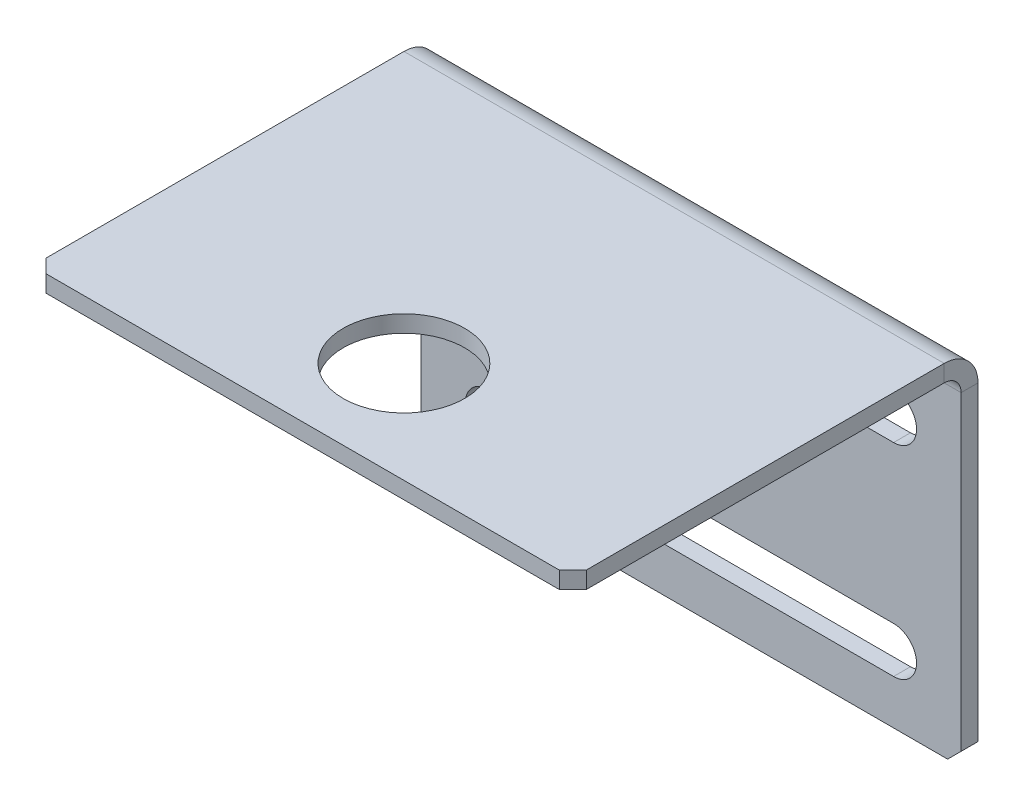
ISO-10303-21;
HEADER;
FILE_DESCRIPTION(('STEP AP214'),'2;1');
FILE_NAME('part.step','',(''),(''),'','','');
FILE_SCHEMA(('AUTOMOTIVE_DESIGN { 1 0 10303 214 1 1 1 1 }'));
ENDSEC;
DATA;
#1=APPLICATION_CONTEXT('core data for automotive mechanical design processes');
#2=APPLICATION_PROTOCOL_DEFINITION('international standard','automotive_design',2000,#1);
#3=PRODUCT_CONTEXT('',#1,'mechanical');
#4=PRODUCT('Part','Part','',(#3));
#5=PRODUCT_RELATED_PRODUCT_CATEGORY('part','',(#4));
#6=PRODUCT_DEFINITION_FORMATION('','',#4);
#7=PRODUCT_DEFINITION_CONTEXT('part definition',#1,'design');
#8=PRODUCT_DEFINITION('design','',#6,#7);
#9=PRODUCT_DEFINITION_SHAPE('','',#8);
#10=(LENGTH_UNIT() NAMED_UNIT(*) SI_UNIT(.MILLI.,.METRE.));
#11=(NAMED_UNIT(*) PLANE_ANGLE_UNIT() SI_UNIT($,.RADIAN.));
#12=(NAMED_UNIT(*) SI_UNIT($,.STERADIAN.) SOLID_ANGLE_UNIT());
#13=UNCERTAINTY_MEASURE_WITH_UNIT(LENGTH_MEASURE(1.E-05),#10,'distance_accuracy_value','');
#14=(GEOMETRIC_REPRESENTATION_CONTEXT(3) GLOBAL_UNCERTAINTY_ASSIGNED_CONTEXT((#13)) GLOBAL_UNIT_ASSIGNED_CONTEXT((#10,
#11,#12)) REPRESENTATION_CONTEXT('',''));
#15=CARTESIAN_POINT('',(0.,0.,0.));
#16=DIRECTION('',(0.,0.,1.));
#17=DIRECTION('',(1.,0.,0.));
#18=AXIS2_PLACEMENT_3D('',#15,#16,#17);
#19=CARTESIAN_POINT('',(40.,48.,9.43689570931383E-13));
#20=DIRECTION('',(1.,0.,0.));
#21=DIRECTION('',(0.,0.,-1.));
#22=AXIS2_PLACEMENT_3D('',#19,#20,#21);
#23=PLANE('',#22);
#24=DIRECTION('',(0.,0.,1.));
#25=VECTOR('',#24,1.);
#26=CARTESIAN_POINT('',(40.,48.,9.43689570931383E-13));
#27=LINE('',#26,#25);
#28=CARTESIAN_POINT('',(40.,48.,9.43689570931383E-13));
#29=VERTEX_POINT('',#28);
#30=CARTESIAN_POINT('',(40.,48.,2.50000000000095));
#31=VERTEX_POINT('',#30);
#32=EDGE_CURVE('E358',#29,#31,#27,.T.);
#33=ORIENTED_EDGE('',*,*,#32,.F.);
#34=CARTESIAN_POINT('',(40.,48.,5.00000000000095));
#35=DIRECTION('',(-1.,0.,0.));
#36=DIRECTION('',(0.,0.,1.));
#37=AXIS2_PLACEMENT_3D('',#34,#35,#36);
#38=CIRCLE('',#37,5.);
#39=CARTESIAN_POINT('',(40.,53.,5.00000000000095));
#40=VERTEX_POINT('',#39);
#41=EDGE_CURVE('E314',#29,#40,#38,.F.);
#42=ORIENTED_EDGE('',*,*,#41,.T.);
#43=DIRECTION('',(0.,1.,0.));
#44=VECTOR('',#43,1.);
#45=CARTESIAN_POINT('',(40.,50.5,5.00000000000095));
#46=LINE('',#45,#44);
#47=CARTESIAN_POINT('',(40.,50.5,5.00000000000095));
#48=VERTEX_POINT('',#47);
#49=EDGE_CURVE('E355',#48,#40,#46,.T.);
#50=ORIENTED_EDGE('',*,*,#49,.F.);
#51=CARTESIAN_POINT('',(40.,48.,5.00000000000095));
#52=DIRECTION('',(1.,0.,0.));
#53=DIRECTION('',(0.,0.,-1.));
#54=AXIS2_PLACEMENT_3D('',#51,#52,#53);
#55=CIRCLE('',#54,2.5);
#56=EDGE_CURVE('E304',#31,#48,#55,.T.);
#57=ORIENTED_EDGE('',*,*,#56,.F.);
#58=EDGE_LOOP('',(#33,#42,#50,#57));
#59=FACE_BOUND('',#58,.T.);
#60=ADVANCED_FACE('F40',(#59),#23,.T.);
#61=CARTESIAN_POINT('',(40.,50.5,5.00000000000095));
#62=DIRECTION('',(1.,0.,0.));
#63=DIRECTION('',(0.,0.,-1.));
#64=AXIS2_PLACEMENT_3D('',#61,#62,#63);
#65=PLANE('',#64);
#66=DIRECTION('',(0.,1.,0.));
#67=VECTOR('',#66,1.);
#68=CARTESIAN_POINT('',(40.,0.,2.50000000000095));
#69=LINE('',#68,#67);
#70=CARTESIAN_POINT('',(40.,2.,2.50000000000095));
#71=VERTEX_POINT('',#70);
#72=EDGE_CURVE('E308',#71,#31,#69,.T.);
#73=ORIENTED_EDGE('',*,*,#72,.F.);
#74=DIRECTION('',(0.,0.,-1.));
#75=VECTOR('',#74,1.);
#76=CARTESIAN_POINT('',(40.,2.,5.00000000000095));
#77=LINE('',#76,#75);
#78=CARTESIAN_POINT('',(40.,2.,9.43689570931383E-13));
#79=VERTEX_POINT('',#78);
#80=EDGE_CURVE('E384',#71,#79,#77,.T.);
#81=ORIENTED_EDGE('',*,*,#80,.T.);
#82=DIRECTION('',(0.,1.,0.));
#83=VECTOR('',#82,1.);
#84=CARTESIAN_POINT('',(40.,0.,9.43689570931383E-13));
#85=LINE('',#84,#83);
#86=EDGE_CURVE('E311',#79,#29,#85,.T.);
#87=ORIENTED_EDGE('',*,*,#86,.T.);
#88=ORIENTED_EDGE('',*,*,#32,.T.);
#89=EDGE_LOOP('',(#73,#81,#87,#88));
#90=FACE_BOUND('',#89,.T.);
#91=ADVANCED_FACE('F464',(#90),#65,.T.);
#92=CARTESIAN_POINT('',(-39.9999999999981,53.,5.00000000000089));
#93=DIRECTION('',(-1.,0.,0.));
#94=DIRECTION('',(0.,0.,1.));
#95=AXIS2_PLACEMENT_3D('',#92,#93,#94);
#96=PLANE('',#95);
#97=DIRECTION('',(0.,-1.,0.));
#98=VECTOR('',#97,1.);
#99=CARTESIAN_POINT('',(-39.9999999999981,53.,5.00000000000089));
#100=LINE('',#99,#98);
#101=CARTESIAN_POINT('',(-39.9999999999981,53.,5.00000000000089));
#102=VERTEX_POINT('',#101);
#103=CARTESIAN_POINT('',(-39.9999999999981,50.5,5.00000000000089));
#104=VERTEX_POINT('',#103);
#105=EDGE_CURVE('E352',#102,#104,#100,.T.);
#106=ORIENTED_EDGE('',*,*,#105,.F.);
#107=CARTESIAN_POINT('',(-39.9999999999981,48.,5.00000000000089));
#108=DIRECTION('',(-1.,0.,0.));
#109=DIRECTION('',(0.,0.,1.));
#110=AXIS2_PLACEMENT_3D('',#107,#108,#109);
#111=CIRCLE('',#110,5.);
#112=CARTESIAN_POINT('',(-39.9999999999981,48.,9.43689570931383E-13));
#113=VERTEX_POINT('',#112);
#114=EDGE_CURVE('E292',#113,#102,#111,.F.);
#115=ORIENTED_EDGE('',*,*,#114,.F.);
#116=DIRECTION('',(0.,0.,-1.));
#117=VECTOR('',#116,1.);
#118=CARTESIAN_POINT('',(-39.9999999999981,48.,2.50000000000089));
#119=LINE('',#118,#117);
#120=CARTESIAN_POINT('',(-39.9999999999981,48.,2.50000000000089));
#121=VERTEX_POINT('',#120);
#122=EDGE_CURVE('E348',#121,#113,#119,.T.);
#123=ORIENTED_EDGE('',*,*,#122,.F.);
#124=CARTESIAN_POINT('',(-39.9999999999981,48.,5.00000000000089));
#125=DIRECTION('',(1.,0.,0.));
#126=DIRECTION('',(0.,0.,-1.));
#127=AXIS2_PLACEMENT_3D('',#124,#125,#126);
#128=CIRCLE('',#127,2.5);
#129=EDGE_CURVE('E282',#121,#104,#128,.T.);
#130=ORIENTED_EDGE('',*,*,#129,.T.);
#131=EDGE_LOOP('',(#106,#115,#123,#130));
#132=FACE_BOUND('',#131,.T.);
#133=ADVANCED_FACE('F438',(#132),#96,.T.);
#134=CARTESIAN_POINT('',(-39.9999999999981,48.,2.50000000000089));
#135=DIRECTION('',(-1.,0.,0.));
#136=DIRECTION('',(0.,0.,1.));
#137=AXIS2_PLACEMENT_3D('',#134,#135,#136);
#138=PLANE('',#137);
#139=DIRECTION('',(0.,0.,1.));
#140=VECTOR('',#139,1.);
#141=CARTESIAN_POINT('',(-39.9999999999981,50.5,9.43689570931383E-13));
#142=LINE('',#141,#140);
#143=CARTESIAN_POINT('',(-40.,50.5,58.));
#144=VERTEX_POINT('',#143);
#145=EDGE_CURVE('E278',#104,#144,#142,.T.);
#146=ORIENTED_EDGE('',*,*,#145,.T.);
#147=DIRECTION('',(0.,1.,0.));
#148=VECTOR('',#147,1.);
#149=CARTESIAN_POINT('',(-40.,47.9999999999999,58.));
#150=LINE('',#149,#148);
#151=CARTESIAN_POINT('',(-40.,52.9999999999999,58.));
#152=VERTEX_POINT('',#151);
#153=EDGE_CURVE('E403',#144,#152,#150,.T.);
#154=ORIENTED_EDGE('',*,*,#153,.T.);
#155=DIRECTION('',(0.,0.,1.));
#156=VECTOR('',#155,1.);
#157=CARTESIAN_POINT('',(-39.9999999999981,53.,9.43689570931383E-13));
#158=LINE('',#157,#156);
#159=EDGE_CURVE('E271',#102,#152,#158,.T.);
#160=ORIENTED_EDGE('',*,*,#159,.F.);
#161=ORIENTED_EDGE('',*,*,#105,.T.);
#162=EDGE_LOOP('',(#146,#154,#160,#161));
#163=FACE_BOUND('',#162,.T.);
#164=ADVANCED_FACE('F426',(#163),#138,.T.);
#165=CARTESIAN_POINT('',(40.,53.,9.43689570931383E-13));
#166=DIRECTION('',(0.,-1.,0.));
#167=DIRECTION('',(0.,0.,-1.));
#168=AXIS2_PLACEMENT_3D('',#165,#166,#167);
#169=PLANE('',#168);
#170=CARTESIAN_POINT('',(0.,52.9999999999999,45.));
#171=DIRECTION('',(0.,1.,0.));
#172=DIRECTION('',(0.,0.,1.));
#173=AXIS2_PLACEMENT_3D('',#170,#171,#172);
#174=CIRCLE('',#173,9.);
#175=CARTESIAN_POINT('',(1.88737914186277E-12,52.9999999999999,54.));
#176=VERTEX_POINT('',#175);
#177=EDGE_CURVE('E267',#176,#176,#174,.T.);
#178=ORIENTED_EDGE('',*,*,#177,.F.);
#179=EDGE_LOOP('',(#178));
#180=FACE_BOUND('',#179,.T.);
#181=ORIENTED_EDGE('',*,*,#159,.T.);
#182=DIRECTION('',(-0.707106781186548,0.,-0.707106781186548));
#183=VECTOR('',#182,1.);
#184=CARTESIAN_POINT('',(-40.,52.9999999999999,58.));
#185=LINE('',#184,#183);
#186=CARTESIAN_POINT('',(-38.,52.9999999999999,60.0000000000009));
#187=VERTEX_POINT('',#186);
#188=EDGE_CURVE('E407',#152,#187,#185,.F.);
#189=ORIENTED_EDGE('',*,*,#188,.T.);
#190=DIRECTION('',(-1.,0.,0.));
#191=VECTOR('',#190,1.);
#192=CARTESIAN_POINT('',(40.,53.,60.0000000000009));
#193=LINE('',#192,#191);
#194=CARTESIAN_POINT('',(38.,53.,60.0000000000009));
#195=VERTEX_POINT('',#194);
#196=EDGE_CURVE('E344',#195,#187,#193,.T.);
#197=ORIENTED_EDGE('',*,*,#196,.F.);
#198=DIRECTION('',(-0.707106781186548,0.,0.707106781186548));
#199=VECTOR('',#198,1.);
#200=CARTESIAN_POINT('',(38.,53.,60.0000000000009));
#201=LINE('',#200,#199);
#202=CARTESIAN_POINT('',(40.,53.,58.0000000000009));
#203=VERTEX_POINT('',#202);
#204=EDGE_CURVE('E394',#195,#203,#201,.F.);
#205=ORIENTED_EDGE('',*,*,#204,.T.);
#206=DIRECTION('',(0.,0.,1.));
#207=VECTOR('',#206,1.);
#208=CARTESIAN_POINT('',(40.,53.,9.43689570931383E-13));
#209=LINE('',#208,#207);
#210=EDGE_CURVE('E296',#40,#203,#209,.T.);
#211=ORIENTED_EDGE('',*,*,#210,.F.);
#212=DIRECTION('',(-1.,0.,0.));
#213=VECTOR('',#212,1.);
#214=CARTESIAN_POINT('',(40.,53.,5.00000000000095));
#215=LINE('',#214,#213);
#216=EDGE_CURVE('E318',#40,#102,#215,.T.);
#217=ORIENTED_EDGE('',*,*,#216,.T.);
#218=EDGE_LOOP('',(#181,#189,#197,#205,#211,#217));
#219=FACE_BOUND('',#218,.T.);
#220=ADVANCED_FACE('F428',(#180,#219),#169,.F.);
#221=CARTESIAN_POINT('',(40.,50.5,60.0000000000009));
#222=DIRECTION('',(0.,0.,1.));
#223=DIRECTION('',(1.,0.,0.));
#224=AXIS2_PLACEMENT_3D('',#221,#222,#223);
#225=PLANE('',#224);
#226=ORIENTED_EDGE('',*,*,#196,.T.);
#227=DIRECTION('',(0.,-1.,0.));
#228=VECTOR('',#227,1.);
#229=CARTESIAN_POINT('',(-38.,50.5,60.0000000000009));
#230=LINE('',#229,#228);
#231=CARTESIAN_POINT('',(-37.9999999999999,50.5,60.0000000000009));
#232=VERTEX_POINT('',#231);
#233=EDGE_CURVE('E48',#187,#232,#230,.T.);
#234=ORIENTED_EDGE('',*,*,#233,.T.);
#235=DIRECTION('',(-1.,0.,0.));
#236=VECTOR('',#235,1.);
#237=CARTESIAN_POINT('',(40.,50.5,60.0000000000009));
#238=LINE('',#237,#236);
#239=CARTESIAN_POINT('',(38.,50.5,60.0000000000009));
#240=VERTEX_POINT('',#239);
#241=EDGE_CURVE('E340',#240,#232,#238,.T.);
#242=ORIENTED_EDGE('',*,*,#241,.F.);
#243=DIRECTION('',(0.,1.,0.));
#244=VECTOR('',#243,1.);
#245=CARTESIAN_POINT('',(38.,50.5,60.0000000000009));
#246=LINE('',#245,#244);
#247=EDGE_CURVE('E390',#240,#195,#246,.T.);
#248=ORIENTED_EDGE('',*,*,#247,.T.);
#249=EDGE_LOOP('',(#226,#234,#242,#248));
#250=FACE_BOUND('',#249,.T.);
#251=ADVANCED_FACE('F413',(#250),#225,.T.);
#252=CARTESIAN_POINT('',(40.,50.5,9.43689570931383E-13));
#253=DIRECTION('',(0.,-1.,0.));
#254=DIRECTION('',(0.,0.,-1.));
#255=AXIS2_PLACEMENT_3D('',#252,#253,#254);
#256=PLANE('',#255);
#257=CARTESIAN_POINT('',(0.,50.5,45.));
#258=DIRECTION('',(0.,-1.,0.));
#259=DIRECTION('',(0.,0.,-1.));
#260=AXIS2_PLACEMENT_3D('',#257,#258,#259);
#261=CIRCLE('',#260,9.);
#262=CARTESIAN_POINT('',(1.88737914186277E-12,50.5,54.));
#263=VERTEX_POINT('',#262);
#264=EDGE_CURVE('E266',#263,#263,#261,.F.);
#265=ORIENTED_EDGE('',*,*,#264,.T.);
#266=EDGE_LOOP('',(#265));
#267=FACE_BOUND('',#266,.T.);
#268=ORIENTED_EDGE('',*,*,#241,.T.);
#269=DIRECTION('',(0.707106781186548,0.,0.707106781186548));
#270=VECTOR('',#269,1.);
#271=CARTESIAN_POINT('',(-28.9999999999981,50.5,69.));
#272=LINE('',#271,#270);
#273=EDGE_CURVE('E11',#232,#144,#272,.F.);
#274=ORIENTED_EDGE('',*,*,#273,.T.);
#275=ORIENTED_EDGE('',*,*,#145,.F.);
#276=DIRECTION('',(-1.,0.,0.));
#277=VECTOR('',#276,1.);
#278=CARTESIAN_POINT('',(40.,50.5,5.00000000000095));
#279=LINE('',#278,#277);
#280=EDGE_CURVE('E336',#48,#104,#279,.T.);
#281=ORIENTED_EDGE('',*,*,#280,.F.);
#282=DIRECTION('',(0.,0.,1.));
#283=VECTOR('',#282,1.);
#284=CARTESIAN_POINT('',(40.,50.5,9.43689570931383E-13));
#285=LINE('',#284,#283);
#286=CARTESIAN_POINT('',(40.,50.5,58.0000000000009));
#287=VERTEX_POINT('',#286);
#288=EDGE_CURVE('E300',#48,#287,#285,.T.);
#289=ORIENTED_EDGE('',*,*,#288,.T.);
#290=DIRECTION('',(0.707106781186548,0.,-0.707106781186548));
#291=VECTOR('',#290,1.);
#292=CARTESIAN_POINT('',(69.,50.4999999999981,29.0000000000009));
#293=LINE('',#292,#291);
#294=EDGE_CURVE('E400',#287,#240,#293,.F.);
#295=ORIENTED_EDGE('',*,*,#294,.T.);
#296=EDGE_LOOP('',(#268,#274,#275,#281,#289,#295));
#297=FACE_BOUND('',#296,.T.);
#298=ADVANCED_FACE('F419',(#267,#297),#256,.T.);
#299=CARTESIAN_POINT('',(40.,48.,5.00000000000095));
#300=DIRECTION('',(-1.,0.,0.));
#301=DIRECTION('',(0.,0.,1.));
#302=AXIS2_PLACEMENT_3D('',#299,#300,#301);
#303=CYLINDRICAL_SURFACE('',#302,2.5);
#304=ORIENTED_EDGE('',*,*,#129,.F.);
#305=DIRECTION('',(-1.,0.,0.));
#306=VECTOR('',#305,1.);
#307=CARTESIAN_POINT('',(40.,48.,2.50000000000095));
#308=LINE('',#307,#306);
#309=EDGE_CURVE('E332',#31,#121,#308,.T.);
#310=ORIENTED_EDGE('',*,*,#309,.F.);
#311=ORIENTED_EDGE('',*,*,#56,.T.);
#312=ORIENTED_EDGE('',*,*,#280,.T.);
#313=EDGE_LOOP('',(#304,#310,#311,#312));
#314=FACE_BOUND('',#313,.T.);
#315=ADVANCED_FACE('F442',(#314),#303,.F.);
#316=CARTESIAN_POINT('',(40.,0.,2.50000000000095));
#317=DIRECTION('',(0.,0.,1.));
#318=DIRECTION('',(1.,0.,0.));
#319=AXIS2_PLACEMENT_3D('',#316,#317,#318);
#320=PLANE('',#319);
#321=CARTESIAN_POINT('',(-29.9999999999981,40.,2.5));
#322=DIRECTION('',(0.,0.,1.));
#323=DIRECTION('',(-1.,0.,0.));
#324=AXIS2_PLACEMENT_3D('',#321,#322,#323);
#325=CIRCLE('',#324,3.4);
#326=CARTESIAN_POINT('',(-29.9999999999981,43.4,2.5));
#327=VERTEX_POINT('',#326);
#328=CARTESIAN_POINT('',(-29.9999999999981,36.6,2.5));
#329=VERTEX_POINT('',#328);
#330=EDGE_CURVE('E55',#327,#329,#325,.T.);
#331=ORIENTED_EDGE('',*,*,#330,.F.);
#332=DIRECTION('',(-1.,0.,0.));
#333=VECTOR('',#332,1.);
#334=CARTESIAN_POINT('',(-29.9999999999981,43.4,2.5));
#335=LINE('',#334,#333);
#336=CARTESIAN_POINT('',(30.,43.4,2.5));
#337=VERTEX_POINT('',#336);
#338=EDGE_CURVE('E185',#337,#327,#335,.T.);
#339=ORIENTED_EDGE('',*,*,#338,.F.);
#340=CARTESIAN_POINT('',(30.,40.,2.5));
#341=DIRECTION('',(0.,0.,1.));
#342=DIRECTION('',(1.,0.,0.));
#343=AXIS2_PLACEMENT_3D('',#340,#341,#342);
#344=CIRCLE('',#343,3.4);
#345=CARTESIAN_POINT('',(30.,36.6,2.5));
#346=VERTEX_POINT('',#345);
#347=EDGE_CURVE('E212',#346,#337,#344,.T.);
#348=ORIENTED_EDGE('',*,*,#347,.F.);
#349=DIRECTION('',(1.,0.,0.));
#350=VECTOR('',#349,1.);
#351=CARTESIAN_POINT('',(-29.9999999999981,36.6,2.5));
#352=LINE('',#351,#350);
#353=EDGE_CURVE('E204',#329,#346,#352,.T.);
#354=ORIENTED_EDGE('',*,*,#353,.F.);
#355=EDGE_LOOP('',(#331,#339,#348,#354));
#356=FACE_BOUND('',#355,.T.);
#357=CARTESIAN_POINT('',(-29.9999999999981,10.,2.5));
#358=DIRECTION('',(0.,0.,1.));
#359=DIRECTION('',(-1.,0.,0.));
#360=AXIS2_PLACEMENT_3D('',#357,#358,#359);
#361=CIRCLE('',#360,3.4);
#362=CARTESIAN_POINT('',(-29.9999999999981,13.4,2.5));
#363=VERTEX_POINT('',#362);
#364=CARTESIAN_POINT('',(-29.9999999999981,6.60000000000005,2.5));
#365=VERTEX_POINT('',#364);
#366=EDGE_CURVE('E236',#363,#365,#361,.T.);
#367=ORIENTED_EDGE('',*,*,#366,.F.);
#368=DIRECTION('',(-1.,0.,0.));
#369=VECTOR('',#368,1.);
#370=CARTESIAN_POINT('',(-29.9999999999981,13.4,2.5));
#371=LINE('',#370,#369);
#372=CARTESIAN_POINT('',(30.,13.4,2.5));
#373=VERTEX_POINT('',#372);
#374=EDGE_CURVE('E246',#373,#363,#371,.T.);
#375=ORIENTED_EDGE('',*,*,#374,.F.);
#376=CARTESIAN_POINT('',(30.,10.,2.5));
#377=DIRECTION('',(0.,0.,1.));
#378=DIRECTION('',(1.,0.,0.));
#379=AXIS2_PLACEMENT_3D('',#376,#377,#378);
#380=CIRCLE('',#379,3.4);
#381=CARTESIAN_POINT('',(30.,6.60000000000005,2.5));
#382=VERTEX_POINT('',#381);
#383=EDGE_CURVE('E242',#382,#373,#380,.T.);
#384=ORIENTED_EDGE('',*,*,#383,.F.);
#385=DIRECTION('',(1.,0.,0.));
#386=VECTOR('',#385,1.);
#387=CARTESIAN_POINT('',(-29.9999999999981,6.60000000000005,2.5));
#388=LINE('',#387,#386);
#389=EDGE_CURVE('E238',#365,#382,#388,.T.);
#390=ORIENTED_EDGE('',*,*,#389,.F.);
#391=EDGE_LOOP('',(#367,#375,#384,#390));
#392=FACE_BOUND('',#391,.T.);
#393=DIRECTION('',(-1.,0.,0.));
#394=VECTOR('',#393,1.);
#395=CARTESIAN_POINT('',(40.,0.,2.50000000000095));
#396=LINE('',#395,#394);
#397=CARTESIAN_POINT('',(38.,0.,2.5));
#398=VERTEX_POINT('',#397);
#399=CARTESIAN_POINT('',(-37.9999999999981,0.,2.50000000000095));
#400=VERTEX_POINT('',#399);
#401=EDGE_CURVE('E329',#398,#400,#396,.T.);
#402=ORIENTED_EDGE('',*,*,#401,.F.);
#403=DIRECTION('',(-0.707106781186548,-0.707106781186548,0.));
#404=VECTOR('',#403,1.);
#405=CARTESIAN_POINT('',(39.,1.,2.50000000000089));
#406=LINE('',#405,#404);
#407=EDGE_CURVE('E381',#398,#71,#406,.F.);
#408=ORIENTED_EDGE('',*,*,#407,.T.);
#409=ORIENTED_EDGE('',*,*,#72,.T.);
#410=ORIENTED_EDGE('',*,*,#309,.T.);
#411=DIRECTION('',(0.,1.,0.));
#412=VECTOR('',#411,1.);
#413=CARTESIAN_POINT('',(-39.9999999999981,0.,2.5));
#414=LINE('',#413,#412);
#415=CARTESIAN_POINT('',(-39.9999999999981,2.,2.5));
#416=VERTEX_POINT('',#415);
#417=EDGE_CURVE('E286',#416,#121,#414,.T.);
#418=ORIENTED_EDGE('',*,*,#417,.F.);
#419=DIRECTION('',(0.707106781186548,-0.707106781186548,0.));
#420=VECTOR('',#419,1.);
#421=CARTESIAN_POINT('',(1.00000000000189,-39.0000000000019,2.5));
#422=LINE('',#421,#420);
#423=EDGE_CURVE('E366',#416,#400,#422,.T.);
#424=ORIENTED_EDGE('',*,*,#423,.T.);
#425=EDGE_LOOP('',(#402,#408,#409,#410,#418,#424));
#426=FACE_BOUND('',#425,.T.);
#427=ADVANCED_FACE('F483',(#356,#392,#426),#320,.T.);
#428=CARTESIAN_POINT('',(40.,0.,9.43689570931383E-13));
#429=DIRECTION('',(0.,-1.,0.));
#430=DIRECTION('',(0.,0.,-1.));
#431=AXIS2_PLACEMENT_3D('',#428,#429,#430);
#432=PLANE('',#431);
#433=DIRECTION('',(-1.,0.,0.));
#434=VECTOR('',#433,1.);
#435=CARTESIAN_POINT('',(40.,0.,9.43689570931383E-13));
#436=LINE('',#435,#434);
#437=CARTESIAN_POINT('',(38.,0.,0.));
#438=VERTEX_POINT('',#437);
#439=CARTESIAN_POINT('',(-37.999999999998,0.,9.43689570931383E-13));
#440=VERTEX_POINT('',#439);
#441=EDGE_CURVE('E326',#438,#440,#436,.T.);
#442=ORIENTED_EDGE('',*,*,#441,.F.);
#443=DIRECTION('',(0.,0.,1.));
#444=VECTOR('',#443,1.);
#445=CARTESIAN_POINT('',(38.,0.,0.));
#446=LINE('',#445,#444);
#447=EDGE_CURVE('E377',#438,#398,#446,.T.);
#448=ORIENTED_EDGE('',*,*,#447,.T.);
#449=ORIENTED_EDGE('',*,*,#401,.T.);
#450=DIRECTION('',(0.,0.,-1.));
#451=VECTOR('',#450,1.);
#452=CARTESIAN_POINT('',(-37.9999999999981,0.,9.43689570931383E-13));
#453=LINE('',#452,#451);
#454=EDGE_CURVE('E370',#400,#440,#453,.T.);
#455=ORIENTED_EDGE('',*,*,#454,.T.);
#456=EDGE_LOOP('',(#442,#448,#449,#455));
#457=FACE_BOUND('',#456,.T.);
#458=ADVANCED_FACE('F489',(#457),#432,.T.);
#459=CARTESIAN_POINT('',(40.,0.,9.43689570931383E-13));
#460=DIRECTION('',(0.,0.,1.));
#461=DIRECTION('',(1.,0.,0.));
#462=AXIS2_PLACEMENT_3D('',#459,#460,#461);
#463=PLANE('',#462);
#464=DIRECTION('',(1.,0.,0.));
#465=VECTOR('',#464,1.);
#466=CARTESIAN_POINT('',(-29.9999999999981,43.4,0.));
#467=LINE('',#466,#465);
#468=CARTESIAN_POINT('',(-29.9999999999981,43.4,0.));
#469=VERTEX_POINT('',#468);
#470=CARTESIAN_POINT('',(30.,43.4,0.));
#471=VERTEX_POINT('',#470);
#472=EDGE_CURVE('E198',#469,#471,#467,.T.);
#473=ORIENTED_EDGE('',*,*,#472,.F.);
#474=CARTESIAN_POINT('',(-29.9999999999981,40.,0.));
#475=DIRECTION('',(0.,0.,1.));
#476=DIRECTION('',(1.,0.,0.));
#477=AXIS2_PLACEMENT_3D('',#474,#475,#476);
#478=CIRCLE('',#477,3.4);
#479=CARTESIAN_POINT('',(-29.9999999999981,36.6,0.));
#480=VERTEX_POINT('',#479);
#481=EDGE_CURVE('E178',#480,#469,#478,.F.);
#482=ORIENTED_EDGE('',*,*,#481,.F.);
#483=DIRECTION('',(-1.,0.,0.));
#484=VECTOR('',#483,1.);
#485=CARTESIAN_POINT('',(-29.9999999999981,36.6,0.));
#486=LINE('',#485,#484);
#487=CARTESIAN_POINT('',(30.,36.6,0.));
#488=VERTEX_POINT('',#487);
#489=EDGE_CURVE('E188',#488,#480,#486,.T.);
#490=ORIENTED_EDGE('',*,*,#489,.F.);
#491=CARTESIAN_POINT('',(30.,40.,0.));
#492=DIRECTION('',(0.,0.,1.));
#493=DIRECTION('',(1.,0.,0.));
#494=AXIS2_PLACEMENT_3D('',#491,#492,#493);
#495=CIRCLE('',#494,3.4);
#496=EDGE_CURVE('E63',#471,#488,#495,.F.);
#497=ORIENTED_EDGE('',*,*,#496,.F.);
#498=EDGE_LOOP('',(#473,#482,#490,#497));
#499=FACE_BOUND('',#498,.T.);
#500=DIRECTION('',(1.,0.,0.));
#501=VECTOR('',#500,1.);
#502=CARTESIAN_POINT('',(-29.9999999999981,13.4,0.));
#503=LINE('',#502,#501);
#504=CARTESIAN_POINT('',(-29.9999999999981,13.4,0.));
#505=VERTEX_POINT('',#504);
#506=CARTESIAN_POINT('',(30.,13.4,0.));
#507=VERTEX_POINT('',#506);
#508=EDGE_CURVE('E228',#505,#507,#503,.T.);
#509=ORIENTED_EDGE('',*,*,#508,.F.);
#510=CARTESIAN_POINT('',(-29.9999999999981,10.,0.));
#511=DIRECTION('',(0.,0.,1.));
#512=DIRECTION('',(1.,0.,0.));
#513=AXIS2_PLACEMENT_3D('',#510,#511,#512);
#514=CIRCLE('',#513,3.4);
#515=CARTESIAN_POINT('',(-29.9999999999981,6.60000000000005,0.));
#516=VERTEX_POINT('',#515);
#517=EDGE_CURVE('E232',#516,#505,#514,.F.);
#518=ORIENTED_EDGE('',*,*,#517,.F.);
#519=DIRECTION('',(-1.,0.,0.));
#520=VECTOR('',#519,1.);
#521=CARTESIAN_POINT('',(-29.9999999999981,6.60000000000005,0.));
#522=LINE('',#521,#520);
#523=CARTESIAN_POINT('',(30.,6.60000000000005,0.));
#524=VERTEX_POINT('',#523);
#525=EDGE_CURVE('E254',#524,#516,#522,.T.);
#526=ORIENTED_EDGE('',*,*,#525,.F.);
#527=CARTESIAN_POINT('',(30.,10.,0.));
#528=DIRECTION('',(0.,0.,1.));
#529=DIRECTION('',(1.,0.,0.));
#530=AXIS2_PLACEMENT_3D('',#527,#528,#529);
#531=CIRCLE('',#530,3.4);
#532=EDGE_CURVE('E192',#507,#524,#531,.F.);
#533=ORIENTED_EDGE('',*,*,#532,.F.);
#534=EDGE_LOOP('',(#509,#518,#526,#533));
#535=FACE_BOUND('',#534,.T.);
#536=ORIENTED_EDGE('',*,*,#86,.F.);
#537=DIRECTION('',(0.707106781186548,0.707106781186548,0.));
#538=VECTOR('',#537,1.);
#539=CARTESIAN_POINT('',(38.,0.,0.));
#540=LINE('',#539,#538);
#541=EDGE_CURVE('E387',#79,#438,#540,.F.);
#542=ORIENTED_EDGE('',*,*,#541,.T.);
#543=ORIENTED_EDGE('',*,*,#441,.T.);
#544=DIRECTION('',(-0.707106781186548,0.707106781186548,0.));
#545=VECTOR('',#544,1.);
#546=CARTESIAN_POINT('',(-39.9999999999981,2.,0.));
#547=LINE('',#546,#545);
#548=CARTESIAN_POINT('',(-39.9999999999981,2.,0.));
#549=VERTEX_POINT('',#548);
#550=EDGE_CURVE('E374',#440,#549,#547,.T.);
#551=ORIENTED_EDGE('',*,*,#550,.T.);
#552=DIRECTION('',(0.,1.,0.));
#553=VECTOR('',#552,1.);
#554=CARTESIAN_POINT('',(-39.9999999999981,0.,0.));
#555=LINE('',#554,#553);
#556=EDGE_CURVE('E289',#549,#113,#555,.T.);
#557=ORIENTED_EDGE('',*,*,#556,.T.);
#558=DIRECTION('',(-1.,0.,0.));
#559=VECTOR('',#558,1.);
#560=CARTESIAN_POINT('',(40.,48.,9.43689570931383E-13));
#561=LINE('',#560,#559);
#562=EDGE_CURVE('E322',#29,#113,#561,.T.);
#563=ORIENTED_EDGE('',*,*,#562,.F.);
#564=EDGE_LOOP('',(#536,#542,#543,#551,#557,#563));
#565=FACE_BOUND('',#564,.T.);
#566=ADVANCED_FACE('F195',(#499,#535,#565),#463,.F.);
#567=CARTESIAN_POINT('',(40.,48.,5.00000000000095));
#568=DIRECTION('',(-1.,0.,0.));
#569=DIRECTION('',(0.,0.,1.));
#570=AXIS2_PLACEMENT_3D('',#567,#568,#569);
#571=CYLINDRICAL_SURFACE('',#570,5.);
#572=ORIENTED_EDGE('',*,*,#114,.T.);
#573=ORIENTED_EDGE('',*,*,#216,.F.);
#574=ORIENTED_EDGE('',*,*,#41,.F.);
#575=ORIENTED_EDGE('',*,*,#562,.T.);
#576=EDGE_LOOP('',(#572,#573,#574,#575));
#577=FACE_BOUND('',#576,.T.);
#578=ADVANCED_FACE('F433',(#577),#571,.T.);
#579=CARTESIAN_POINT('',(40.,48.,5.00000000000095));
#580=DIRECTION('',(1.,0.,0.));
#581=DIRECTION('',(0.,0.,-1.));
#582=AXIS2_PLACEMENT_3D('',#579,#580,#581);
#583=PLANE('',#582);
#584=ORIENTED_EDGE('',*,*,#210,.T.);
#585=DIRECTION('',(0.,-1.,0.));
#586=VECTOR('',#585,1.);
#587=CARTESIAN_POINT('',(40.,48.,58.0000000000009));
#588=LINE('',#587,#586);
#589=EDGE_CURVE('E397',#203,#287,#588,.T.);
#590=ORIENTED_EDGE('',*,*,#589,.T.);
#591=ORIENTED_EDGE('',*,*,#288,.F.);
#592=ORIENTED_EDGE('',*,*,#49,.T.);
#593=EDGE_LOOP('',(#584,#590,#591,#592));
#594=FACE_BOUND('',#593,.T.);
#595=ADVANCED_FACE('F447',(#594),#583,.T.);
#596=CARTESIAN_POINT('',(-39.9999999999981,48.,5.00000000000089));
#597=DIRECTION('',(1.,0.,0.));
#598=DIRECTION('',(0.,0.,-1.));
#599=AXIS2_PLACEMENT_3D('',#596,#597,#598);
#600=PLANE('',#599);
#601=ORIENTED_EDGE('',*,*,#556,.F.);
#602=DIRECTION('',(0.,0.,1.));
#603=VECTOR('',#602,1.);
#604=CARTESIAN_POINT('',(-39.9999999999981,2.,2.5));
#605=LINE('',#604,#603);
#606=EDGE_CURVE('E362',#549,#416,#605,.T.);
#607=ORIENTED_EDGE('',*,*,#606,.T.);
#608=ORIENTED_EDGE('',*,*,#417,.T.);
#609=ORIENTED_EDGE('',*,*,#122,.T.);
#610=EDGE_LOOP('',(#601,#607,#608,#609));
#611=FACE_BOUND('',#610,.T.);
#612=ADVANCED_FACE('F479',(#611),#600,.F.);
#613=CARTESIAN_POINT('',(-39.9999999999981,2.,5.));
#614=DIRECTION('',(-0.707106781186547,-0.707106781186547,0.));
#615=DIRECTION('',(0.707106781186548,-0.707106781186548,0.));
#616=AXIS2_PLACEMENT_3D('',#613,#614,#615);
#617=PLANE('',#616);
#618=ORIENTED_EDGE('',*,*,#550,.F.);
#619=ORIENTED_EDGE('',*,*,#454,.F.);
#620=ORIENTED_EDGE('',*,*,#423,.F.);
#621=ORIENTED_EDGE('',*,*,#606,.F.);
#622=EDGE_LOOP('',(#618,#619,#620,#621));
#623=FACE_BOUND('',#622,.T.);
#624=ADVANCED_FACE('F460',(#623),#617,.T.);
#625=CARTESIAN_POINT('',(38.,0.,0.));
#626=DIRECTION('',(-0.707106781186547,0.707106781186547,0.));
#627=DIRECTION('',(-0.707106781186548,-0.707106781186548,0.));
#628=AXIS2_PLACEMENT_3D('',#625,#626,#627);
#629=PLANE('',#628);
#630=ORIENTED_EDGE('',*,*,#541,.F.);
#631=ORIENTED_EDGE('',*,*,#80,.F.);
#632=ORIENTED_EDGE('',*,*,#407,.F.);
#633=ORIENTED_EDGE('',*,*,#447,.F.);
#634=EDGE_LOOP('',(#630,#631,#632,#633));
#635=FACE_BOUND('',#634,.T.);
#636=ADVANCED_FACE('F452',(#635),#629,.F.);
#637=CARTESIAN_POINT('',(38.,50.5,60.0000000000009));
#638=DIRECTION('',(-0.707106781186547,0.,-0.707106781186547));
#639=DIRECTION('',(-0.707106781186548,0.,0.707106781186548));
#640=AXIS2_PLACEMENT_3D('',#637,#638,#639);
#641=PLANE('',#640);
#642=ORIENTED_EDGE('',*,*,#294,.F.);
#643=ORIENTED_EDGE('',*,*,#589,.F.);
#644=ORIENTED_EDGE('',*,*,#204,.F.);
#645=ORIENTED_EDGE('',*,*,#247,.F.);
#646=EDGE_LOOP('',(#642,#643,#644,#645));
#647=FACE_BOUND('',#646,.T.);
#648=ADVANCED_FACE('F450',(#647),#641,.F.);
#649=CARTESIAN_POINT('',(-40.,47.9999999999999,58.));
#650=DIRECTION('',(0.707106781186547,0.,-0.707106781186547));
#651=DIRECTION('',(-0.707106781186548,0.,-0.707106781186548));
#652=AXIS2_PLACEMENT_3D('',#649,#650,#651);
#653=PLANE('',#652);
#654=ORIENTED_EDGE('',*,*,#273,.F.);
#655=ORIENTED_EDGE('',*,*,#233,.F.);
#656=ORIENTED_EDGE('',*,*,#188,.F.);
#657=ORIENTED_EDGE('',*,*,#153,.F.);
#658=EDGE_LOOP('',(#654,#655,#656,#657));
#659=FACE_BOUND('',#658,.T.);
#660=ADVANCED_FACE('F423',(#659),#653,.F.);
#661=CARTESIAN_POINT('',(1.88737914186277E-12,-0.00100000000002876,45.));
#662=DIRECTION('',(0.,1.,0.));
#663=DIRECTION('',(0.,0.,1.));
#664=AXIS2_PLACEMENT_3D('',#661,#662,#663);
#665=CYLINDRICAL_SURFACE('',#664,9.);
#666=CARTESIAN_POINT('',(1.88737914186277E-12,50.5,54.));
#667=CARTESIAN_POINT('',(1.88737914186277E-12,50.5260416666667,54.));
#668=CARTESIAN_POINT('',(1.88737914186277E-12,50.5520833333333,54.));
#669=CARTESIAN_POINT('',(1.88737914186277E-12,50.6041666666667,54.));
#670=CARTESIAN_POINT('',(1.88737914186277E-12,50.6302083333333,54.));
#671=CARTESIAN_POINT('',(1.88737914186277E-12,50.6822916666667,54.));
#672=CARTESIAN_POINT('',(1.88737914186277E-12,50.7083333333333,54.));
#673=CARTESIAN_POINT('',(1.88737914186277E-12,50.7604166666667,54.));
#674=CARTESIAN_POINT('',(1.88737914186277E-12,50.7864583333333,54.));
#675=CARTESIAN_POINT('',(1.88737914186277E-12,50.8385416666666,54.));
#676=CARTESIAN_POINT('',(1.88737914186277E-12,50.8645833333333,54.));
#677=CARTESIAN_POINT('',(1.88737914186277E-12,50.9166666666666,54.));
#678=CARTESIAN_POINT('',(1.88737914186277E-12,50.9427083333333,54.));
#679=CARTESIAN_POINT('',(1.88737914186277E-12,50.9947916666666,54.));
#680=CARTESIAN_POINT('',(1.88737914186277E-12,51.0208333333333,54.));
#681=CARTESIAN_POINT('',(1.88737914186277E-12,51.0729166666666,54.));
#682=CARTESIAN_POINT('',(1.88737914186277E-12,51.0989583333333,54.));
#683=CARTESIAN_POINT('',(1.88737914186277E-12,51.1510416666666,54.));
#684=CARTESIAN_POINT('',(1.88737914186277E-12,51.1770833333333,54.));
#685=CARTESIAN_POINT('',(1.88737914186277E-12,51.2291666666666,54.));
#686=CARTESIAN_POINT('',(1.88737914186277E-12,51.2552083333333,54.));
#687=CARTESIAN_POINT('',(1.88737914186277E-12,51.3072916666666,54.));
#688=CARTESIAN_POINT('',(1.88737914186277E-12,51.3333333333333,54.));
#689=CARTESIAN_POINT('',(1.88737914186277E-12,51.3854166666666,54.));
#690=CARTESIAN_POINT('',(1.88737914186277E-12,51.4114583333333,54.));
#691=CARTESIAN_POINT('',(1.88737914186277E-12,51.4635416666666,54.));
#692=CARTESIAN_POINT('',(1.88737914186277E-12,51.4895833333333,54.));
#693=CARTESIAN_POINT('',(1.88737914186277E-12,51.5416666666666,54.));
#694=CARTESIAN_POINT('',(1.88737914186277E-12,51.5677083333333,54.));
#695=CARTESIAN_POINT('',(1.88737914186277E-12,51.6197916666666,54.));
#696=CARTESIAN_POINT('',(1.88737914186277E-12,51.6458333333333,54.));
#697=CARTESIAN_POINT('',(1.88737914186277E-12,51.6979166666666,54.));
#698=CARTESIAN_POINT('',(1.88737914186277E-12,51.7239583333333,54.));
#699=CARTESIAN_POINT('',(1.88737914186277E-12,51.7760416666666,54.));
#700=CARTESIAN_POINT('',(1.88737914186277E-12,51.8020833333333,54.));
#701=CARTESIAN_POINT('',(1.88737914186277E-12,51.8541666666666,54.));
#702=CARTESIAN_POINT('',(1.88737914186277E-12,51.8802083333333,54.));
#703=CARTESIAN_POINT('',(1.88737914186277E-12,51.9322916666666,54.));
#704=CARTESIAN_POINT('',(1.88737914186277E-12,51.9583333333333,54.));
#705=CARTESIAN_POINT('',(1.88737914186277E-12,52.0104166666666,54.));
#706=CARTESIAN_POINT('',(1.88737914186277E-12,52.0364583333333,54.));
#707=CARTESIAN_POINT('',(1.88737914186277E-12,52.0885416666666,54.));
#708=CARTESIAN_POINT('',(1.88737914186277E-12,52.1145833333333,54.));
#709=CARTESIAN_POINT('',(1.88737914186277E-12,52.1666666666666,54.));
#710=CARTESIAN_POINT('',(1.88737914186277E-12,52.1927083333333,54.));
#711=CARTESIAN_POINT('',(1.88737914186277E-12,52.2447916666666,54.));
#712=CARTESIAN_POINT('',(1.88737914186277E-12,52.2708333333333,54.));
#713=CARTESIAN_POINT('',(1.88737914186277E-12,52.3229166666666,54.));
#714=CARTESIAN_POINT('',(1.88737914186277E-12,52.3489583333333,54.));
#715=CARTESIAN_POINT('',(1.88737914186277E-12,52.4010416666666,54.));
#716=CARTESIAN_POINT('',(1.88737914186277E-12,52.4270833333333,54.));
#717=CARTESIAN_POINT('',(1.88737914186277E-12,52.4791666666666,54.));
#718=CARTESIAN_POINT('',(1.88737914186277E-12,52.5052083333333,54.));
#719=CARTESIAN_POINT('',(1.88737914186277E-12,52.5572916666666,54.));
#720=CARTESIAN_POINT('',(1.88737914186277E-12,52.5833333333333,54.));
#721=CARTESIAN_POINT('',(1.88737914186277E-12,52.6354166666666,54.));
#722=CARTESIAN_POINT('',(1.88737914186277E-12,52.6614583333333,54.));
#723=CARTESIAN_POINT('',(1.88737914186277E-12,52.7135416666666,54.));
#724=CARTESIAN_POINT('',(1.88737914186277E-12,52.7395833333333,54.));
#725=CARTESIAN_POINT('',(1.88737914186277E-12,52.7916666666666,54.));
#726=CARTESIAN_POINT('',(1.88737914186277E-12,52.8177083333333,54.));
#727=CARTESIAN_POINT('',(1.88737914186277E-12,52.8697916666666,54.));
#728=CARTESIAN_POINT('',(1.88737914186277E-12,52.8958333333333,54.));
#729=CARTESIAN_POINT('',(1.88737914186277E-12,52.9479166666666,54.));
#730=CARTESIAN_POINT('',(1.88737914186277E-12,52.9739583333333,54.));
#731=CARTESIAN_POINT('',(1.88737914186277E-12,52.9999999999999,54.));
#732=B_SPLINE_CURVE_WITH_KNOTS('',3,(#666,#667,#668,#669,#670,#671,#672,#673,#674,#675,#676,
#677,#678,#679,#680,#681,#682,#683,#684,#685,#686,#687,#688,#689,#690,#691,#692,#693,#694,#695,
#696,#697,#698,#699,#700,#701,#702,#703,#704,#705,#706,#707,#708,#709,#710,#711,#712,#713,#714,
#715,#716,#717,#718,#719,#720,#721,#722,#723,#724,#725,#726,#727,#728,#729,#730,#731),
.UNSPECIFIED.,.F.,.F.,(4,2,2,2,2,2,2,2,2,2,2,2,2,2,2,2,2,2,2,2,2,2,2,2,2,2,2,2,2,2,2,2,4),(0.,
0.0781249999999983,0.156249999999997,0.234374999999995,0.312499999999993,0.390624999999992,
0.46874999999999,0.546874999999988,0.624999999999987,0.703124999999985,0.781249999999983,
0.859374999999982,0.93749999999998,1.01562499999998,1.09374999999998,1.17187499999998,
1.24999999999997,1.32812499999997,1.40624999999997,1.48437499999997,1.56249999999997,
1.64062499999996,1.71874999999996,1.79687499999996,1.87499999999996,1.95312499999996,
2.03124999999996,2.10937499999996,2.18749999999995,2.26562499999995,2.34374999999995,
2.42187499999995,2.49999999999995),.UNSPECIFIED.);
#733=EDGE_CURVE('BSEAM458',#263,#176,#732,.T.);
#734=ORIENTED_EDGE('',*,*,#264,.F.);
#735=ORIENTED_EDGE('',*,*,#177,.T.);
#736=ORIENTED_EDGE('',*,*,#733,.T.);
#737=ORIENTED_EDGE('',*,*,#733,.F.);
#738=EDGE_LOOP('',(#734,#736,#735,#737));
#739=FACE_BOUND('',#738,.T.);
#740=ADVANCED_FACE('F458',(#739),#665,.F.);
#741=CARTESIAN_POINT('',(-29.9999999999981,10.,-0.000999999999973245));
#742=DIRECTION('',(0.,0.,1.));
#743=DIRECTION('',(1.,0.,0.));
#744=AXIS2_PLACEMENT_3D('',#741,#742,#743);
#745=CYLINDRICAL_SURFACE('',#744,3.4);
#746=ORIENTED_EDGE('',*,*,#517,.T.);
#747=DIRECTION('',(0.,0.,1.));
#748=VECTOR('',#747,1.);
#749=CARTESIAN_POINT('',(-29.9999999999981,13.4,-0.000999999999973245));
#750=LINE('',#749,#748);
#751=EDGE_CURVE('E251',#505,#363,#750,.T.);
#752=ORIENTED_EDGE('',*,*,#751,.T.);
#753=ORIENTED_EDGE('',*,*,#366,.T.);
#754=DIRECTION('',(0.,0.,1.));
#755=VECTOR('',#754,1.);
#756=CARTESIAN_POINT('',(-29.9999999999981,6.60000000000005,-0.000999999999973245));
#757=LINE('',#756,#755);
#758=EDGE_CURVE('E250',#516,#365,#757,.T.);
#759=ORIENTED_EDGE('',*,*,#758,.F.);
#760=EDGE_LOOP('',(#746,#752,#753,#759));
#761=FACE_BOUND('',#760,.T.);
#762=ADVANCED_FACE('F594',(#761),#745,.F.);
#763=CARTESIAN_POINT('',(-29.9999999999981,13.4,-0.000999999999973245));
#764=DIRECTION('',(0.,1.,0.));
#765=DIRECTION('',(0.,0.,1.));
#766=AXIS2_PLACEMENT_3D('',#763,#764,#765);
#767=PLANE('',#766);
#768=ORIENTED_EDGE('',*,*,#508,.T.);
#769=DIRECTION('',(0.,0.,1.));
#770=VECTOR('',#769,1.);
#771=CARTESIAN_POINT('',(30.,13.4,-0.00100000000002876));
#772=LINE('',#771,#770);
#773=EDGE_CURVE('E255',#507,#373,#772,.T.);
#774=ORIENTED_EDGE('',*,*,#773,.T.);
#775=ORIENTED_EDGE('',*,*,#374,.T.);
#776=ORIENTED_EDGE('',*,*,#751,.F.);
#777=EDGE_LOOP('',(#768,#774,#775,#776));
#778=FACE_BOUND('',#777,.T.);
#779=ADVANCED_FACE('F603',(#778),#767,.F.);
#780=CARTESIAN_POINT('',(30.,10.,-0.00100000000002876));
#781=DIRECTION('',(0.,0.,1.));
#782=DIRECTION('',(1.,0.,0.));
#783=AXIS2_PLACEMENT_3D('',#780,#781,#782);
#784=CYLINDRICAL_SURFACE('',#783,3.4);
#785=ORIENTED_EDGE('',*,*,#532,.T.);
#786=DIRECTION('',(0.,0.,1.));
#787=VECTOR('',#786,1.);
#788=CARTESIAN_POINT('',(30.,6.60000000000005,-0.00100000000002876));
#789=LINE('',#788,#787);
#790=EDGE_CURVE('E258',#524,#382,#789,.T.);
#791=ORIENTED_EDGE('',*,*,#790,.T.);
#792=ORIENTED_EDGE('',*,*,#383,.T.);
#793=ORIENTED_EDGE('',*,*,#773,.F.);
#794=EDGE_LOOP('',(#785,#791,#792,#793));
#795=FACE_BOUND('',#794,.T.);
#796=ADVANCED_FACE('F612',(#795),#784,.F.);
#797=CARTESIAN_POINT('',(-29.9999999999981,6.60000000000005,-0.000999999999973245));
#798=DIRECTION('',(0.,-1.,0.));
#799=DIRECTION('',(0.,0.,-1.));
#800=AXIS2_PLACEMENT_3D('',#797,#798,#799);
#801=PLANE('',#800);
#802=ORIENTED_EDGE('',*,*,#525,.T.);
#803=ORIENTED_EDGE('',*,*,#758,.T.);
#804=ORIENTED_EDGE('',*,*,#389,.T.);
#805=ORIENTED_EDGE('',*,*,#790,.F.);
#806=EDGE_LOOP('',(#802,#803,#804,#805));
#807=FACE_BOUND('',#806,.T.);
#808=ADVANCED_FACE('F621',(#807),#801,.F.);
#809=CARTESIAN_POINT('',(-29.9999999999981,40.,-0.000999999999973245));
#810=DIRECTION('',(0.,0.,1.));
#811=DIRECTION('',(1.,0.,0.));
#812=AXIS2_PLACEMENT_3D('',#809,#810,#811);
#813=CYLINDRICAL_SURFACE('',#812,3.4);
#814=ORIENTED_EDGE('',*,*,#481,.T.);
#815=DIRECTION('',(0.,0.,1.));
#816=VECTOR('',#815,1.);
#817=CARTESIAN_POINT('',(-29.9999999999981,43.4,-0.000999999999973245));
#818=LINE('',#817,#816);
#819=EDGE_CURVE('E193',#469,#327,#818,.T.);
#820=ORIENTED_EDGE('',*,*,#819,.T.);
#821=ORIENTED_EDGE('',*,*,#330,.T.);
#822=DIRECTION('',(0.,0.,1.));
#823=VECTOR('',#822,1.);
#824=CARTESIAN_POINT('',(-29.9999999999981,36.6,-0.000999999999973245));
#825=LINE('',#824,#823);
#826=EDGE_CURVE('E174',#480,#329,#825,.T.);
#827=ORIENTED_EDGE('',*,*,#826,.F.);
#828=EDGE_LOOP('',(#814,#820,#821,#827));
#829=FACE_BOUND('',#828,.T.);
#830=ADVANCED_FACE('F176',(#829),#813,.F.);
#831=CARTESIAN_POINT('',(-29.9999999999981,43.4,-0.000999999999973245));
#832=DIRECTION('',(0.,1.,0.));
#833=DIRECTION('',(0.,0.,1.));
#834=AXIS2_PLACEMENT_3D('',#831,#832,#833);
#835=PLANE('',#834);
#836=ORIENTED_EDGE('',*,*,#472,.T.);
#837=DIRECTION('',(0.,0.,1.));
#838=VECTOR('',#837,1.);
#839=CARTESIAN_POINT('',(30.,43.4,-0.000999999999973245));
#840=LINE('',#839,#838);
#841=EDGE_CURVE('E221',#471,#337,#840,.T.);
#842=ORIENTED_EDGE('',*,*,#841,.T.);
#843=ORIENTED_EDGE('',*,*,#338,.T.);
#844=ORIENTED_EDGE('',*,*,#819,.F.);
#845=EDGE_LOOP('',(#836,#842,#843,#844));
#846=FACE_BOUND('',#845,.T.);
#847=ADVANCED_FACE('F638',(#846),#835,.F.);
#848=CARTESIAN_POINT('',(30.,40.,-0.000999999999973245));
#849=DIRECTION('',(0.,0.,1.));
#850=DIRECTION('',(1.,0.,0.));
#851=AXIS2_PLACEMENT_3D('',#848,#849,#850);
#852=CYLINDRICAL_SURFACE('',#851,3.4);
#853=ORIENTED_EDGE('',*,*,#496,.T.);
#854=DIRECTION('',(0.,0.,1.));
#855=VECTOR('',#854,1.);
#856=CARTESIAN_POINT('',(30.,36.6,-0.000999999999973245));
#857=LINE('',#856,#855);
#858=EDGE_CURVE('E184',#488,#346,#857,.T.);
#859=ORIENTED_EDGE('',*,*,#858,.T.);
#860=ORIENTED_EDGE('',*,*,#347,.T.);
#861=ORIENTED_EDGE('',*,*,#841,.F.);
#862=EDGE_LOOP('',(#853,#859,#860,#861));
#863=FACE_BOUND('',#862,.T.);
#864=ADVANCED_FACE('F646',(#863),#852,.F.);
#865=CARTESIAN_POINT('',(-29.9999999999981,36.6,-0.000999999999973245));
#866=DIRECTION('',(0.,-1.,0.));
#867=DIRECTION('',(0.,0.,-1.));
#868=AXIS2_PLACEMENT_3D('',#865,#866,#867);
#869=PLANE('',#868);
#870=ORIENTED_EDGE('',*,*,#489,.T.);
#871=ORIENTED_EDGE('',*,*,#826,.T.);
#872=ORIENTED_EDGE('',*,*,#353,.T.);
#873=ORIENTED_EDGE('',*,*,#858,.F.);
#874=EDGE_LOOP('',(#870,#871,#872,#873));
#875=FACE_BOUND('',#874,.T.);
#876=ADVANCED_FACE('F189',(#875),#869,.F.);
#877=CLOSED_SHELL('',(#60,#91,#133,#164,#220,#251,#298,#315,#427,#458,#566,#578,#595,#612,#624,
#636,#648,#660,#740,#762,#779,#796,#808,#830,#847,#864,#876));
#878=MANIFOLD_SOLID_BREP('B2',#877);
#879=ADVANCED_BREP_SHAPE_REPRESENTATION('',(#18,#878),#14);
#880=SHAPE_DEFINITION_REPRESENTATION(#9,#879);
ENDSEC;
END-ISO-10303-21;
